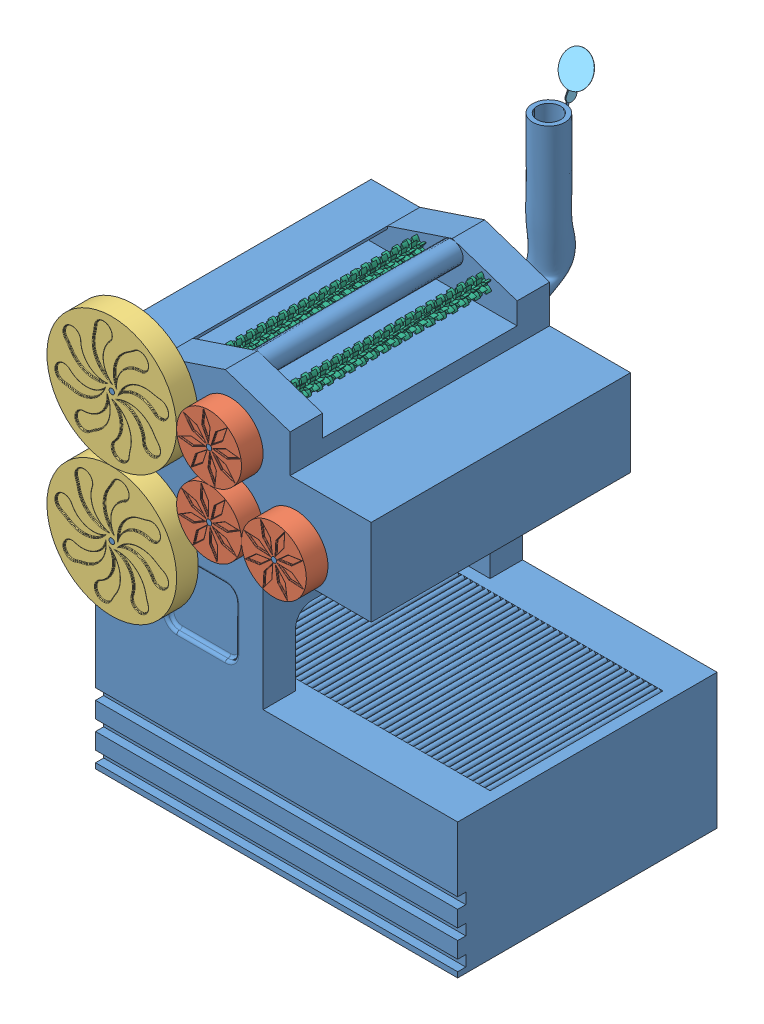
SolidWorks assembly machine 1 working.SLDASM, configuration Default (file format 9000). Lengths in mm.
Overall size (1948.55 2446.45 1783.14).
82 component instances, 6 part files, 26 mates.
Components (placement in the parent):
- machine 1-1: machine 1.SLDPRT [Default] at (-75.0705 329.54 2362.1141) size (1701.8 2309.55 1740.93)
- 12 gear-1: 12 gear.SLDPRT [Default] at (864.7295 1701.14 2362.1141) x (-0.905458 -0.424435 0) z (0 0 1) size (304.8 304.8 101.6)
- 12 gear-2: 12 gear.SLDPRT [Default] at (559.9295 2005.94 2362.1141) x (-0.821692 0.569932 0) z (0 0 1) size (304.8 304.8 101.6)
- 12 gear-3: 12 gear.SLDPRT [Default] at (559.9295 1701.14 2362.1141) x (-0.9669 -0.255156 0) z (0 0 1) size (304.8 304.8 101.6)
- 24 gear-2: 24 gear.SLDPRT [Default] at (102.7295 1396.34 2362.1141) x (0.81877 0.574122 0) z (0 0 1) size (609.6 609.6 102.53)
- coveyor track-21: coveyor track.SLDPRT [Default] at (1499.9479 900.7904 2158.9141) x (0 0 -1) z (0.977133 0.212627 0) size (812.8 30.48 4.91)
- exaust flap-1: exaust flap.SLDPRT [Default] at (585.3295 2709.6752 763.5326) x (0 -0.870296 0.49253) z (1 0 0) size (197.33 51.13 152.4)
- spinner string-1: spinner string.SLDASM [Default] at (348.2544 2109.4863 2138.3015) size (106.74 105.96 914.4)
  - teeth-1: teeth.SLDPRT [Default] at (33.8751 48.8537 46.0127) size (73.59 70.22 25.4)
  - teeth-2: teeth.SLDPRT [Default] at (33.8751 48.8537 -715.9873) x (0.689096 0.72467 0) z (0 0 1) size (73.59 70.22 25.4)
  - teeth-3: teeth.SLDPRT [Default] at (33.8751 48.8537 -588.9873) x (0.328355 0.944554 0) z (0 0 1) size (73.59 70.22 25.4)
  - teeth-4: teeth.SLDPRT [Default] at (33.8751 48.8537 20.6127) x (0.784538 0.620081 0) z (0 0 1) size (73.59 70.22 25.4)
  - teeth-5: teeth.SLDPRT [Default] at (33.8751 48.8537 -385.7873) x (0.476503 0.879173 0) z (0 0 1) size (73.59 70.22 25.4)
  - teeth-6: teeth.SLDPRT [Default] at (33.8751 48.8537 -411.1873) x (0.658961 -0.752177 0) z (0 0 1) size (73.59 70.22 25.4)
  - teeth-7: teeth.SLDPRT [Default] at (33.8751 48.8537 -182.5873) x (0.910758 -0.41294 0) z (0 0 1) size (73.59 70.22 25.4)
  - teeth-8: teeth.SLDPRT [Default] at (33.8751 48.8537 -157.1873) x (0.070933 0.997481 0) z (0 0 1) size (73.59 70.22 25.4)
  - teeth-9: teeth.SLDPRT [Default] at (33.8751 48.8537 -106.3873) x (0.986889 0.161402 0) z (0 0 1) size (73.59 70.22 25.4)
  - teeth-10: teeth.SLDPRT [Default] at (33.8751 48.8537 -55.5873) x (0.458468 -0.888711 0) z (0 0 1) size (73.59 70.22 25.4)
  - teeth-11: teeth.SLDPRT [Default] at (33.8751 48.8537 -80.9873) x (0.910758 -0.41294 0) z (0 0 1) size (73.59 70.22 25.4)
  - teeth-12: teeth.SLDPRT [Default] at (33.8751 48.8537 -487.3873) x (0.476503 0.879173 0) z (0 0 1) size (73.59 70.22 25.4)
  - teeth-13: teeth.SLDPRT [Default] at (33.8751 48.8537 -639.7873) x (0.250799 0.968039 0) z (0 0 1) size (73.59 70.22 25.4)
  - teeth-14: teeth.SLDPRT [Default] at (33.8751 48.8537 -538.1873) x (0.403754 0.914867 0) z (0 0 1) size (73.59 70.22 25.4)
  - teeth-15: teeth.SLDPRT [Default] at (33.8751 48.8537 -461.9873) x (0.658961 -0.752177 0) z (0 0 1) size (73.59 70.22 25.4)
  - teeth-16: teeth.SLDPRT [Default] at (33.8751 48.8537 -4.7873) x (0.996717 0.080967 0) z (0 0 1) size (73.59 70.22 25.4)
  - teeth-17: teeth.SLDPRT [Default] at (33.8751 48.8537 -131.7873) x (0.674169 0.738577 0) z (0 0 1) size (73.59 70.22 25.4)
  - teeth-18: teeth.SLDPRT [Default] at (33.8751 48.8537 -614.3873) x (0.797024 0.603947 0) z (0 0 1) size (73.59 70.22 25.4)
  - teeth-19: teeth.SLDPRT [Default] at (33.8751 48.8537 -30.1873) x (0.874334 -0.485325 0) z (0 0 1) size (73.59 70.22 25.4)
  - teeth-20: teeth.SLDPRT [Default] at (33.8751 48.8537 -817.5873) x (0.563098 0.82639 0) z (0 0 1) size (73.59 70.22 25.4)
  - teeth-21: teeth.SLDPRT [Default] at (33.8751 48.8537 -842.9873) x (0.926845 0.375444 0) z (0 0 1) size (73.59 70.22 25.4)
  - teeth-22: teeth.SLDPRT [Default] at (33.8751 48.8537 -563.5873) x (0.843307 0.537432 0) z (0 0 1) size (73.59 70.22 25.4)
  - teeth-23: teeth.SLDPRT [Default] at (33.8751 48.8537 -665.1873) x (0.745508 0.666497 0) z (0 0 1) size (73.59 70.22 25.4)
  - teeth-24: teeth.SLDPRT [Default] at (33.8751 48.8537 -741.3873) x (0.97529 0.220927 0) z (0 0 1) size (73.59 70.22 25.4)
  - teeth-25: teeth.SLDPRT [Default] at (33.8751 48.8537 -792.1873) x (0.954201 0.299168 0) z (0 0 1) size (73.59 70.22 25.4)
  - teeth-26: teeth.SLDPRT [Default] at (33.8751 48.8537 -766.7873) x (0.628159 0.778085 0) z (0 0 1) size (73.59 70.22 25.4)
  - teeth-27: teeth.SLDPRT [Default] at (33.8751 48.8537 -690.5873) x (0.989976 0.141235 0) z (0 0 1) size (73.59 70.22 25.4)
  - teeth-28: teeth.SLDPRT [Default] at (33.8751 48.8537 -512.7873) x (0.884053 0.467387 0) z (0 0 1) size (73.59 70.22 25.4)
  - teeth-29: teeth.SLDPRT [Default] at (33.8751 48.8537 -360.3873) x (0.918993 0.394274 0) z (0 0 1) size (73.59 70.22 25.4)
  - teeth-30: teeth.SLDPRT [Default] at (33.8751 48.8537 -436.5873) x (0.476503 0.879173 0) z (0 0 1) size (73.59 70.22 25.4)
  - teeth-31: teeth.SLDPRT [Default] at (33.8751 48.8537 -334.9873) x (0.546122 0.837706 0) z (0 0 1) size (73.59 70.22 25.4)
  - teeth-32: teeth.SLDPRT [Default] at (33.8751 48.8537 -309.5873) x (-0.579615 -0.814891 0) z (0 0 1) size (73.59 70.22 25.4)
  - teeth-33: teeth.SLDPRT [Default] at (33.8751 48.8537 -284.1873) x (0.612155 0.790738 0) z (0 0 1) size (73.59 70.22 25.4)
  - teeth-34: teeth.SLDPRT [Default] at (33.8751 48.8537 -233.3873) x (0.674169 0.738577 0) z (0 0 1) size (73.59 70.22 25.4)
  - teeth-35: teeth.SLDPRT [Default] at (33.8751 48.8537 -207.9873) x (0.986889 0.161402 0) z (0 0 1) size (73.59 70.22 25.4)
  - teeth-36: teeth.SLDPRT [Default] at (33.8751 48.8537 -258.7873) x (0.97058 0.240777 0) z (0 0 1) size (73.59 70.22 25.4)
- spinner string-2: spinner string.SLDASM [Default] at (653.0544 2109.4863 2138.3015) size (106.74 105.96 914.4)
  - teeth-1: teeth.SLDPRT [Default] at (33.8751 48.8537 46.0127) size (73.59 70.22 25.4)
  - teeth-2: teeth.SLDPRT [Default] at (33.8751 48.8537 -715.9873) x (0.689096 0.72467 0) z (0 0 1) size (73.59 70.22 25.4)
  - teeth-3: teeth.SLDPRT [Default] at (33.8751 48.8537 -588.9873) x (0.328355 0.944554 0) z (0 0 1) size (73.59 70.22 25.4)
  - teeth-4: teeth.SLDPRT [Default] at (33.8751 48.8537 20.6127) x (0.784538 0.620081 0) z (0 0 1) size (73.59 70.22 25.4)
  - teeth-5: teeth.SLDPRT [Default] at (33.8751 48.8537 -385.7873) x (0.476503 0.879173 0) z (0 0 1) size (73.59 70.22 25.4)
  - teeth-6: teeth.SLDPRT [Default] at (33.8751 48.8537 -411.1873) x (0.658961 -0.752177 0) z (0 0 1) size (73.59 70.22 25.4)
  - teeth-7: teeth.SLDPRT [Default] at (33.8751 48.8537 -182.5873) x (0.910758 -0.41294 0) z (0 0 1) size (73.59 70.22 25.4)
  - teeth-8: teeth.SLDPRT [Default] at (33.8751 48.8537 -157.1873) x (0.070933 0.997481 0) z (0 0 1) size (73.59 70.22 25.4)
  - teeth-9: teeth.SLDPRT [Default] at (33.8751 48.8537 -106.3873) x (0.986889 0.161402 0) z (0 0 1) size (73.59 70.22 25.4)
  - teeth-10: teeth.SLDPRT [Default] at (33.8751 48.8537 -55.5873) x (0.458468 -0.888711 0) z (0 0 1) size (73.59 70.22 25.4)
  - teeth-11: teeth.SLDPRT [Default] at (33.8751 48.8537 -80.9873) x (0.910758 -0.41294 0) z (0 0 1) size (73.59 70.22 25.4)
  - teeth-12: teeth.SLDPRT [Default] at (33.8751 48.8537 -487.3873) x (0.476503 0.879173 0) z (0 0 1) size (73.59 70.22 25.4)
  - teeth-13: teeth.SLDPRT [Default] at (33.8751 48.8537 -639.7873) x (0.250799 0.968039 0) z (0 0 1) size (73.59 70.22 25.4)
  - teeth-14: teeth.SLDPRT [Default] at (33.8751 48.8537 -538.1873) x (0.403754 0.914867 0) z (0 0 1) size (73.59 70.22 25.4)
  - teeth-15: teeth.SLDPRT [Default] at (33.8751 48.8537 -461.9873) x (0.658961 -0.752177 0) z (0 0 1) size (73.59 70.22 25.4)
  - teeth-16: teeth.SLDPRT [Default] at (33.8751 48.8537 -4.7873) x (0.996717 0.080967 0) z (0 0 1) size (73.59 70.22 25.4)
  - teeth-17: teeth.SLDPRT [Default] at (33.8751 48.8537 -131.7873) x (0.674169 0.738577 0) z (0 0 1) size (73.59 70.22 25.4)
  - teeth-18: teeth.SLDPRT [Default] at (33.8751 48.8537 -614.3873) x (0.797024 0.603947 0) z (0 0 1) size (73.59 70.22 25.4)
  - teeth-19: teeth.SLDPRT [Default] at (33.8751 48.8537 -30.1873) x (0.874334 -0.485325 0) z (0 0 1) size (73.59 70.22 25.4)
  - teeth-20: teeth.SLDPRT [Default] at (33.8751 48.8537 -817.5873) x (0.563098 0.82639 0) z (0 0 1) size (73.59 70.22 25.4)
  - teeth-21: teeth.SLDPRT [Default] at (33.8751 48.8537 -842.9873) x (0.926845 0.375444 0) z (0 0 1) size (73.59 70.22 25.4)
  - teeth-22: teeth.SLDPRT [Default] at (33.8751 48.8537 -563.5873) x (0.843307 0.537432 0) z (0 0 1) size (73.59 70.22 25.4)
  - teeth-23: teeth.SLDPRT [Default] at (33.8751 48.8537 -665.1873) x (0.745508 0.666497 0) z (0 0 1) size (73.59 70.22 25.4)
  - teeth-24: teeth.SLDPRT [Default] at (33.8751 48.8537 -741.3873) x (0.97529 0.220927 0) z (0 0 1) size (73.59 70.22 25.4)
  - teeth-25: teeth.SLDPRT [Default] at (33.8751 48.8537 -792.1873) x (0.954201 0.299168 0) z (0 0 1) size (73.59 70.22 25.4)
  - teeth-26: teeth.SLDPRT [Default] at (33.8751 48.8537 -766.7873) x (0.628159 0.778085 0) z (0 0 1) size (73.59 70.22 25.4)
  - teeth-27: teeth.SLDPRT [Default] at (33.8751 48.8537 -690.5873) x (0.989976 0.141235 0) z (0 0 1) size (73.59 70.22 25.4)
  - teeth-28: teeth.SLDPRT [Default] at (33.8751 48.8537 -512.7873) x (0.884053 0.467387 0) z (0 0 1) size (73.59 70.22 25.4)
  - teeth-29: teeth.SLDPRT [Default] at (33.8751 48.8537 -360.3873) x (0.918993 0.394274 0) z (0 0 1) size (73.59 70.22 25.4)
  - teeth-30: teeth.SLDPRT [Default] at (33.8751 48.8537 -436.5873) x (0.476503 0.879173 0) z (0 0 1) size (73.59 70.22 25.4)
  - teeth-31: teeth.SLDPRT [Default] at (33.8751 48.8537 -334.9873) x (0.546122 0.837706 0) z (0 0 1) size (73.59 70.22 25.4)
  - teeth-32: teeth.SLDPRT [Default] at (33.8751 48.8537 -309.5873) x (-0.579615 -0.814891 0) z (0 0 1) size (73.59 70.22 25.4)
  - teeth-33: teeth.SLDPRT [Default] at (33.8751 48.8537 -284.1873) x (0.612155 0.790738 0) z (0 0 1) size (73.59 70.22 25.4)
  - teeth-34: teeth.SLDPRT [Default] at (33.8751 48.8537 -233.3873) x (0.674169 0.738577 0) z (0 0 1) size (73.59 70.22 25.4)
  - teeth-35: teeth.SLDPRT [Default] at (33.8751 48.8537 -207.9873) x (0.986889 0.161402 0) z (0 0 1) size (73.59 70.22 25.4)
  - teeth-36: teeth.SLDPRT [Default] at (33.8751 48.8537 -258.7873) x (0.97058 0.240777 0) z (0 0 1) size (73.59 70.22 25.4)
- 24 gear-4: 24 gear.SLDPRT [Default] at (102.7295 2005.94 2362.1141) x (0.81877 -0.574122 0) z (0 0 1) size (609.6 609.6 102.53)
Mates (geometry in assembly coordinates):
- Concentric1: concentric: cylinder of machine 1-1 through (102.7295 1396.34 2463.7141) axis (0 0 -1) radius 12.7; cylinder of 24 gear-2 through (102.7295 1396.34 2463.7141) axis (0 0 -1) radius 12.7
- Coincident1: coincident: plane of machine 1-1 through (102.7295 1396.34 2463.7141) normal (0 0 1); plane of 24 gear-2 through (102.7295 1396.34 2463.7141) normal (0 0 1)
- Concentric3: concentric: cylinder of machine 1-1 through (559.9295 2005.94 2463.7141) axis (0 0 -1) radius 12.7; cylinder of 12 gear-2 through (559.9295 2005.94 2463.7141) axis (0 0 -1) radius 12.7
- Coincident3: coincident: plane of machine 1-1 through (559.9295 2005.94 2463.7141) normal (0 0 1); plane of 12 gear-2 through (559.9295 2005.94 2463.7141) normal (0 0 1)
- Concentric4: concentric: cylinder of machine 1-1 through (559.9295 1701.14 2463.7141) axis (0 0 -1) radius 12.7; cylinder of 12 gear-3 through (559.9295 1701.14 2463.7141) axis (0 0 -1) radius 12.7
- Coincident4: coincident: plane of machine 1-1 through (559.9295 1701.14 2463.7141) normal (0 0 1); plane of 12 gear-3 through (559.9295 1701.14 2463.7141) normal (0 0 1)
- Concentric5: concentric: cylinder of machine 1-1 through (864.7295 1701.14 2463.7141) axis (0 0 -1) radius 12.7; cylinder of 12 gear-1 through (864.7295 1701.14 2463.7141) axis (0 0 -1) radius 12.7
- Coincident5: coincident: circle of machine 1-1; plane of 12 gear-1 through (864.7295 1701.14 2463.7141) normal (0 0 1)
- GearMate3: gear = 304.8 mm: cylinder of 12 gear-3 through (559.9295 1701.14 2463.7141) axis (0 0 -1) radius 152.4; cylinder of 12 gear-2 through (559.9295 2005.94 2463.7141) axis (0 0 -1) radius 152.4
- GearMate4: gear = 304.8 mm: cylinder of 12 gear-1 through (864.7295 1701.14 2463.7141) axis (0 0 -1) radius 152.4; cylinder of 12 gear-3 through (559.9295 1701.14 2463.7141) axis (0 0 -1) radius 152.4
- Coincident9: coincident: plane of machine 1-1 through (586.5995 2613.6863 788.2864) normal (1 0 0); plane of exaust flap-1 through (586.5995 2662.4499 667.6024) normal (-1 0 0)
- Concentric6: concentric: cylinder of machine 1-1 through (584.0595 2613.6863 788.2864) axis (1 0 0) radius 25.4; circle of exaust flap-1
- Concentric7: concentric: cylinder of machine 1-1 through (382.1295 2158.34 2209.7141) axis (0 0 -1) radius 12.7; cylinder of spinner string-1/teeth-1 through (382.1295 2158.34 2209.7141) axis (0 0 -1) radius 12.7
- Coincident10: coincident: plane of machine 1-1 through (-75.0705 2259.94 2209.7141) normal (0 0 -1); plane of spinner string-1/teeth-1 through (381.9934 2135.1824 2209.7141) normal (0 0 1)
- Concentric8: concentric: cylinder of machine 1-1 through (686.9295 2158.34 2209.7141) axis (0 0 -1) radius 12.7; cylinder of spinner string-2/teeth-1 through (686.9295 2158.34 2209.7141) axis (0 0 -1) radius 12.7
- Coincident11: coincident: plane of machine 1-1 through (-75.0705 2259.94 2209.7141) normal (0 0 -1); plane of spinner string-2/teeth-1 through (686.7934 2135.1824 2209.7141) normal (0 0 1)
- GearMate7: gear = 304.8 mm: cylinder of 12 gear-3 through (559.9295 1701.14 2463.7141) axis (0 0 -1) radius 152.4; cylinder of 12 gear-2 through (559.9295 2005.94 2463.7141) axis (0 0 -1) radius 152.4
- GearMate8: gear = 304.8 mm: cylinder of 12 gear-1 through (864.7295 1701.14 2463.7141) axis (0 0 -1) radius 152.4; cylinder of 12 gear-3 through (559.9295 1701.14 2463.7141) axis (0 0 -1) radius 152.4
- GearMate11: gear = 304.8 mm: cylinder of 12 gear-2 through (559.9295 2005.94 2463.7141) axis (0 0 -1) radius 152.4; cylinder of 12 gear-3 through (559.9295 1701.14 2463.7141) axis (0 0 -1) radius 152.4
- GearMate12: gear = 304.8 mm: cylinder of 12 gear-1 through (864.7295 1701.14 2463.7141) axis (0 0 -1) radius 152.4; cylinder of 12 gear-3 through (559.9295 1701.14 2463.7141) axis (0 0 -1) radius 152.4
- Concentric12: concentric: cylinder of machine 1-1 through (102.7295 2005.94 2463.7141) axis (0 0 -1) radius 12.7; cylinder of 24 gear-4 through (102.7295 2005.94 2463.7141) axis (0 0 -1) radius 12.7
- Coincident12: coincident: plane of machine 1-1 through (102.7295 2005.94 2463.7141) normal (0 0 1); plane of 24 gear-4 through (102.7295 2005.94 2463.7141) normal (0 0 1)
- GearMate19: gear = 609.6 mm: cylinder of 24 gear-4 through (102.7295 2005.94 2463.7141) axis (0 0 -1) radius 304.8; cylinder of 24 gear-2 through (102.7295 1396.34 2463.7141) axis (0 0 -1) radius 304.8
- GearMate20: gear = 304.8 mm: cylinder of 24 gear-4 through (102.7295 2005.94 2463.7141) axis (0 0 -1) radius 304.8; cylinder of 12 gear-2 through (559.9295 2005.94 2463.7141) axis (0 0 -1) radius 152.4
- GearMate21: gear = 304.8 mm: cylinder of 12 gear-2 through (559.9295 2005.94 2463.7141) axis (0 0 -1) radius 152.4; cylinder of 12 gear-3 through (559.9295 1701.14 2463.7141) axis (0 0 -1) radius 152.4
- GearMate22: gear = 304.8 mm: cylinder of 12 gear-1 through (864.7295 1701.14 2463.7141) axis (0 0 -1) radius 152.4; cylinder of 12 gear-3 through (559.9295 1701.14 2463.7141) axis (0 0 -1) radius 152.4
